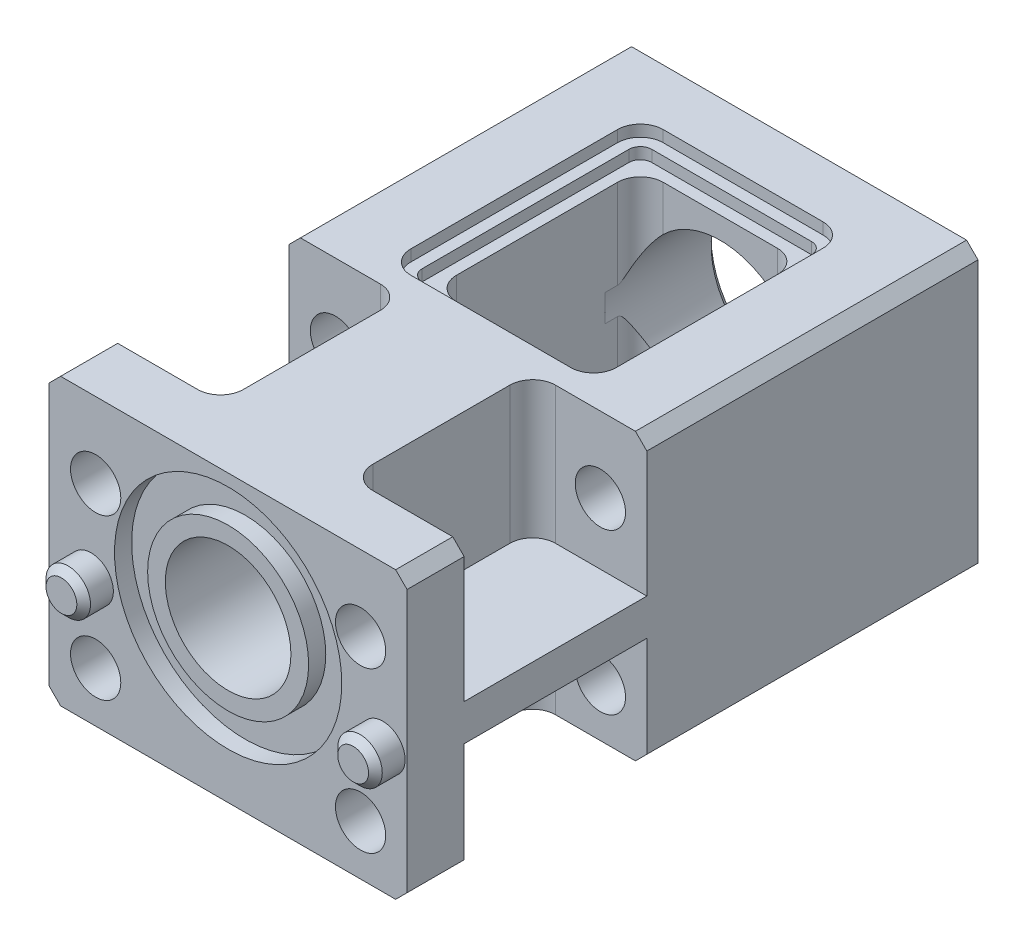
from build123d import *

# Parameters (mm, degrees)
SKETCH_1_W             = 15.67
SKETCH_1_H             = 12.2
EXTRUDE_1_DEPTH        = 25
SKETCH_4_R             = 0.975
EXTRUDE_2_DEPTH        = 1.3
CHAMFER_1_SIZE         = 0.3
CUT_EXTRUDE_12_DEPTH   = 5
SKETCH_17_R            = 1.1
CUT_EXTRUDE_13_DEPTH   = 25.593641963
SKETCH_19_R            = 2.25
CUT_EXTRUDE_15_DEPTH   = 27.899762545
HOLE_WIZARD_M2_1_D     = 1.6
HOLE_WIZARD_M2_1_DEPTH = 14
HOLE_WIZARD_M2_1_TIP   = 0.480688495
SKETCH_23_W            = 7
SKETCH_23_H            = 9.05
CUT_EXTRUDE_16_DEPTH   = 8.7
FILLET_6_R             = 1
SKETCH_24_R            = 3.55
CUT_EXTRUDE_17_DEPTH   = 5
SKETCH_30_W            = 8
SKETCH_30_H            = 1.6
EXTRUDE_4_DEPTH        = 5
SKETCH_31_W            = 8
SKETCH_31_H            = 1.6
EXTRUDE_5_DEPTH        = 5
EXTRUDE_6_DEPTH        = 0.3
SKETCH_33_W            = 9
SKETCH_33_H            = 11.05
CUT_EXTRUDE_20_DEPTH   = 0.5
FILLET_8_R             = 1
CUT_EXTRUDE_21_DEPTH   = 0.5
FILLET_9_R             = 1
CHAMFER_4_SIZE         = 0.5
EXTRUDE_7_DEPTH        = 12.5
FILLET_10_R            = 1
CHAMFER_3_SIZE         = 0.3
SKETCH_36_R            = 4.975
SKETCH_36_R_2          = 3.525
CUT_EXTRUDE_22_DEPTH   = 0.75
CUT_EXTRUDE_START      = -10
SKETCH_37_R            = 1.1
CUT_EXTRUDE_23_DEPTH   = 10
SKETCH_38_R            = 2.75
CUT_EXTRUDE_24_DEPTH   = 20


with BuildPart() as part:
    # Sketch 1 → Extrude 1 (new body)
    with BuildSketch(Plane.XY):
        Rectangle(SKETCH_1_W, SKETCH_1_H)
    extrude(amount=EXTRUDE_1_DEPTH)

    # Sketch 4 → Extrude 2 (add)
    with BuildSketch(Plane.XY.offset(25)):
        with Locations((-6, -0.6)):
            Circle(SKETCH_4_R)
        with Locations((6.775, -0.6)):
            Circle(SKETCH_4_R)
    extrude(amount=EXTRUDE_2_DEPTH)

    # Chamfer 1
    chamfer_1_edges = [part.edges().sort_by_distance(p)[0] for p in [
        (-6.975, -0.6, 26.3),
        (5.8, -0.6, 26.3),
    ]]
    chamfer(chamfer_1_edges, length=CHAMFER_1_SIZE)

    # Sketch 15 → Cut-Extrude 12 (cut)
    with BuildSketch(Plane(origin=(7.835, 0, 0), x_dir=(0, 0, -1), z_dir=(1, 0, 0))):
        Polygon((-22.5, 6.1), (-14.5, 6.1), (-14.5, 2.1), (-14.5, -6.1), (-22.5, -6.1), (-22.5, 2.1), align=None)
    cut_extrude_12 = extrude(amount=-CUT_EXTRUDE_12_DEPTH, mode=Mode.SUBTRACT)

    # Mirror 1: Cut-Extrude 12 across plane
    add(cut_extrude_12.mirror(Plane(origin=(0, 0, 0), x_dir=(0, 0, 1), z_dir=(1, 0, 0))), mode=Mode.SUBTRACT)

    # Sketch 17 → Cut-Extrude 13 (cut, through all)
    with BuildSketch(Plane(origin=(0, 0, 22.5), x_dir=(-1, 0, 0), z_dir=(0, 0, -1))):
        with Locations((-5.8, 3.1)):
            Circle(SKETCH_17_R)
        with Locations((-5.8, -3.9)):
            Circle(SKETCH_17_R)
        with Locations((5.8, -3.9)):
            Circle(SKETCH_17_R)
        with Locations((5.8, 3.1)):
            Circle(SKETCH_17_R)
    extrude(amount=-CUT_EXTRUDE_13_DEPTH, mode=Mode.SUBTRACT)

    # Sketch 19 → Cut-Extrude 15 (cut, through all)
    with BuildSketch(Plane.XY.offset(25)):
        with Locations((0, 0.9)):
            Circle(SKETCH_19_R)
    extrude(amount=-CUT_EXTRUDE_15_DEPTH, mode=Mode.SUBTRACT)

    # Hole Wizard M2 _1
    with Locations(Plane(origin=(0, 0, 0), x_dir=(-1, 0, 0), z_dir=(0, 0, -1))):
        with Locations((-5.8, 3.1), (-5.8, -3.9), (5.8, -3.9), (5.8, 3.1)):
            Hole(HOLE_WIZARD_M2_1_D / 2, depth=HOLE_WIZARD_M2_1_DEPTH)
            with Locations((0, 0, -(HOLE_WIZARD_M2_1_DEPTH + HOLE_WIZARD_M2_1_TIP / 2))):  # 118° drill point
                Cone(0, HOLE_WIZARD_M2_1_D / 2, HOLE_WIZARD_M2_1_TIP, mode=Mode.SUBTRACT)

    # Sketch 23 → Cut-Extrude 16 (cut)
    with BuildSketch(Plane(origin=(0, 6.1, 0), x_dir=(1, 0, 0), z_dir=(0, 1, 0))):
        with Locations((0, -7.975)):
            Rectangle(SKETCH_23_W, SKETCH_23_H)
    extrude(amount=-CUT_EXTRUDE_16_DEPTH, mode=Mode.SUBTRACT)

    # Fillet 6
    fillet_6_edges = [part.edges().sort_by_distance(p)[0] for p in [
        (-3.5, 1.75, 3.45),
        (3.5, 1.75, 12.5),
        (-3.5, 1.75, 12.5),
        (3.5, 1.75, 3.45),
    ]]
    fillet(fillet_6_edges, radius=FILLET_6_R)

    # Sketch 24 → Cut-Extrude 17 (cut)
    with BuildSketch(Plane(origin=(0, 0, 0), x_dir=(-1, 0, 0), z_dir=(0, 0, -1))):
        with Locations((0, 0.9)):
            Circle(SKETCH_24_R)
    extrude(amount=-CUT_EXTRUDE_17_DEPTH, mode=Mode.SUBTRACT)

    # Sketch 30 → Extrude 4 (add)
    with BuildSketch(Plane.ZY.offset(2.835)):
        with Locations((18.5, -0.4)):
            Rectangle(SKETCH_30_W, SKETCH_30_H)
    extrude(amount=EXTRUDE_4_DEPTH)

    # Sketch 31 → Extrude 5 (add)
    with BuildSketch(Plane(origin=(2.835, 0, 0), x_dir=(0, 0, -1), z_dir=(1, 0, 0))):
        with Locations((-18.5, -0.4)):
            Rectangle(SKETCH_31_W, SKETCH_31_H)
    extrude(amount=EXTRUDE_5_DEPTH)

    # Sketch 32 → Extrude 6 (add)
    with BuildSketch(Plane(origin=(0, 6.1, 0), x_dir=(1, 0, 0), z_dir=(0, 1, 0))):
        Polygon((-2.835, -22.5), (-7.835, -22.5), (-7.835, -25), (7.835, -25), (7.835, -22.5), (2.835, -22.5), (2.835, -14.5), (7.835, -14.5), (7.835, 0), (-7.835, 0), (-7.835, -14.5), (-2.835, -14.5), align=None)
        with BuildLine():
            Line((0.593717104, -3.45), (-0.593717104, -3.45))
            Line((-0.593717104, -3.45), (-2.5, -3.45))
            ThreePointArc((-2.5, -3.45), (-3.207106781, -3.742893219), (-3.5, -4.45))
            Line((-3.5, -4.45), (-3.5, -11.5))
            ThreePointArc((-3.5, -11.5), (-3.207106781, -12.207106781), (-2.5, -12.5))
            Line((-2.5, -12.5), (2.5, -12.5))
            ThreePointArc((2.5, -12.5), (3.207106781, -12.207106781), (3.5, -11.5))
            Line((3.5, -11.5), (3.5, -4.45))
            ThreePointArc((3.5, -4.45), (3.207106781, -3.742893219), (2.5, -3.45))
            Line((2.5, -3.45), (0.593717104, -3.45))
        make_face(mode=Mode.SUBTRACT)
    extrude(amount=EXTRUDE_6_DEPTH)

    # Sketch 33 → Cut-Extrude 20 (cut)
    with BuildSketch(Plane(origin=(0, 6.4, 0), x_dir=(1, 0, 0), z_dir=(0, 1, 0))):
        with Locations((0, -7.975)):
            Rectangle(SKETCH_33_W, SKETCH_33_H)
    extrude(amount=-CUT_EXTRUDE_20_DEPTH, mode=Mode.SUBTRACT)

    # Fillet 8
    fillet_8_edges = [part.edges().sort_by_distance(p)[0] for p in [
        (4.5, 6.15, 2.45),
        (4.5, 6.15, 13.5),
        (-4.5, 6.15, 13.5),
        (-4.5, 6.15, 2.45),
    ]]
    fillet(fillet_8_edges, radius=FILLET_8_R)

    # Sketch 34 → Cut-Extrude 21 (cut)
    with BuildSketch(Plane(origin=(0, 5.9, 0), x_dir=(1, 0, 0), z_dir=(0, 1, 0))):
        with BuildLine():
            Line((3.5, -2.95), (-3.5, -2.95))
            ThreePointArc((-3.5, -2.95), (-3.853553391, -3.096446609), (-4, -3.45))
            Line((-4, -3.45), (-4, -12.5))
            ThreePointArc((-4, -12.5), (-3.853553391, -12.853553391), (-3.5, -13))
            Line((-3.5, -13), (3.5, -13))
            ThreePointArc((3.5, -13), (3.853553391, -12.853553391), (4, -12.5))
            Line((4, -12.5), (4, -3.45))
            ThreePointArc((4, -3.45), (3.853553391, -3.096446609), (3.5, -2.95))
        make_face()
    extrude(amount=-CUT_EXTRUDE_21_DEPTH, mode=Mode.SUBTRACT)

    # Fillet 9
    fillet_9_edges = [part.edges().sort_by_distance(p)[0] for p in [
        (-2.835, -3.65, 22.5),
        (-2.835, 3.4, 14.5),
        (2.835, -3.65, 22.5),
        (2.835, 3.4, 14.5),
        (2.835, -3.65, 14.5),
        (2.835, 3.4, 22.5),
        (-2.835, 3.4, 22.5),
        (-2.835, -3.65, 14.5),
    ]]
    fillet(fillet_9_edges, radius=FILLET_9_R)

    # Chamfer 4
    chamfer_4_edges = [part.edges().sort_by_distance(p)[0] for p in [
        (-7.835, 6.4, 23.75),
        (7.835, 6.4, 23.75),
        (7.835, 6.4, 7.25),
        (-7.835, 6.4, 7.25),
        (7.835, -6.1, 7.25),
        (-7.835, -6.1, 7.25),
        (7.835, -6.1, 23.75),
        (-7.835, -6.1, 23.75),
    ]]
    chamfer(chamfer_4_edges, length=CHAMFER_4_SIZE)

    # Sketch 35 → Extrude 7 (add)
    with BuildSketch(Plane.XY.offset(25)):
        with BuildLine():
            Line((-1.75, 2.314213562), (-1.75, -0.514213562))
            ThreePointArc((-1.75, -0.514213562), (-2.25, 0.9), (-1.75, 2.314213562))
        make_face()
        with BuildLine():
            Line((1.75, 2.314213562), (1.75, -0.514213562))
            ThreePointArc((1.75, -0.514213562), (2.25, 0.9), (1.75, 2.314213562))
        make_face()
    extrude(amount=-EXTRUDE_7_DEPTH)

    # Fillet 10
    fillet_10_edges = [part.edges().sort_by_distance(p)[0] for p in [
        (1.75, 2.314213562, 18.75),
        (1.75, -0.514213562, 18.75),
        (-1.75, -0.514213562, 18.75),
        (-1.75, 2.314213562, 18.75),
    ]]
    fillet(fillet_10_edges, radius=FILLET_10_R)

    # Chamfer 3
    chamfer_3_edges = [part.edges().sort_by_distance(p)[0] for p in [
        (3.55, 0.9, 0),
        (0, 3.15, 25),
        (1.75, 0.9, 25),
        (0, -1.35, 25),
        (-1.75, 0.9, 25),
        (1.644427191, 2.347213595, 25),
        (1.644427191, -0.547213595, 25),
        (-1.644427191, -0.547213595, 25),
        (-1.644427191, 2.347213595, 25),
    ]]
    chamfer(chamfer_3_edges, length=CHAMFER_3_SIZE)

    # Sketch 36 → Cut-Extrude 22 (cut)
    with BuildSketch(Plane.XY.offset(25)):
        with Locations((0, 0.9)):
            Circle(SKETCH_36_R)
        with Locations((0, 0.9)):
            Circle(SKETCH_36_R_2, mode=Mode.SUBTRACT)
    extrude(amount=-CUT_EXTRUDE_22_DEPTH, mode=Mode.SUBTRACT)

    # Sketch 37 → Cut-Extrude 23 (cut)
    with BuildSketch(Plane.XY.offset(14.5).offset(CUT_EXTRUDE_START)):
        with Locations(Location((5.8, 3.1, 0), (0, 0, 180))):
            Circle(SKETCH_37_R)
        with Locations(Location((5.8, -3.9, 0), (0, 0, 180))):
            Circle(SKETCH_37_R)
        with Locations(Location((-5.8, 3.1, 0), (0, 0, 180))):
            Circle(SKETCH_37_R)
        with Locations(Location((-5.8, -3.9, 0), (0, 0, 180))):
            Circle(SKETCH_37_R)
    extrude(amount=CUT_EXTRUDE_23_DEPTH, mode=Mode.SUBTRACT)

    # Sketch 38 → Cut-Extrude 24 (cut)
    with BuildSketch(Plane.XY.offset(25)):
        with Locations((0, 0.9)):
            Circle(SKETCH_38_R)
    extrude(amount=-CUT_EXTRUDE_24_DEPTH, mode=Mode.SUBTRACT)


solid = part.part
